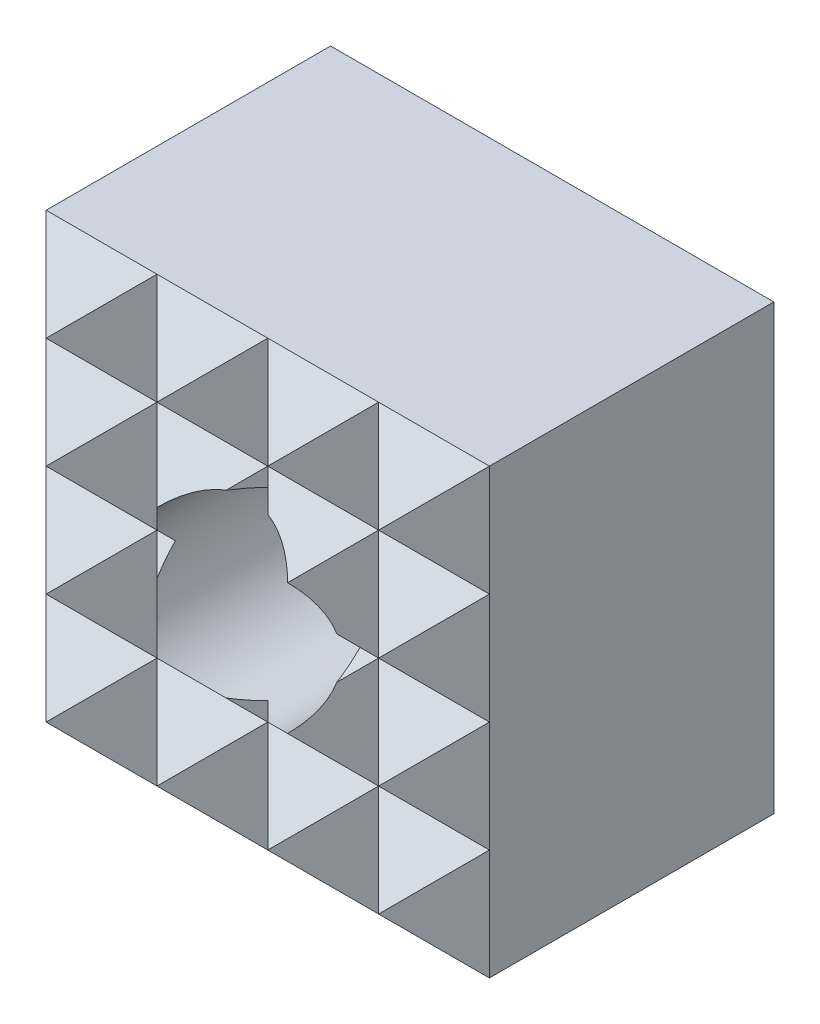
ISO-10303-21;
HEADER;
FILE_DESCRIPTION(('STEP AP214'),'2;1');
FILE_NAME('part.step','',(''),(''),'','','');
FILE_SCHEMA(('AUTOMOTIVE_DESIGN { 1 0 10303 214 1 1 1 1 }'));
ENDSEC;
DATA;
#1=APPLICATION_CONTEXT('core data for automotive mechanical design processes');
#2=APPLICATION_PROTOCOL_DEFINITION('international standard','automotive_design',2000,#1);
#3=PRODUCT_CONTEXT('',#1,'mechanical');
#4=PRODUCT('Part','Part','',(#3));
#5=PRODUCT_RELATED_PRODUCT_CATEGORY('part','',(#4));
#6=PRODUCT_DEFINITION_FORMATION('','',#4);
#7=PRODUCT_DEFINITION_CONTEXT('part definition',#1,'design');
#8=PRODUCT_DEFINITION('design','',#6,#7);
#9=PRODUCT_DEFINITION_SHAPE('','',#8);
#10=(LENGTH_UNIT() NAMED_UNIT(*) SI_UNIT(.MILLI.,.METRE.));
#11=(NAMED_UNIT(*) PLANE_ANGLE_UNIT() SI_UNIT($,.RADIAN.));
#12=(NAMED_UNIT(*) SI_UNIT($,.STERADIAN.) SOLID_ANGLE_UNIT());
#13=UNCERTAINTY_MEASURE_WITH_UNIT(LENGTH_MEASURE(1.E-05),#10,'distance_accuracy_value','');
#14=(GEOMETRIC_REPRESENTATION_CONTEXT(3) GLOBAL_UNCERTAINTY_ASSIGNED_CONTEXT((#13)) GLOBAL_UNIT_ASSIGNED_CONTEXT((#10,
#11,#12)) REPRESENTATION_CONTEXT('',''));
#15=CARTESIAN_POINT('',(0.,0.,0.));
#16=DIRECTION('',(0.,0.,1.));
#17=DIRECTION('',(1.,0.,0.));
#18=AXIS2_PLACEMENT_3D('',#15,#16,#17);
#19=CARTESIAN_POINT('',(-1.49999999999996,-10.,10.));
#20=DIRECTION('',(-0.70710678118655,0.,-0.707106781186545));
#21=DIRECTION('',(-0.707106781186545,0.,0.70710678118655));
#22=AXIS2_PLACEMENT_3D('',#19,#20,#21);
#23=PLANE('',#22);
#24=DIRECTION('',(0.,1.,0.));
#25=VECTOR('',#24,1.);
#26=CARTESIAN_POINT('',(0.,-10.,8.5));
#27=LINE('',#26,#25);
#28=CARTESIAN_POINT('',(0.,2.5,8.5));
#29=VERTEX_POINT('',#28);
#30=CARTESIAN_POINT('',(0.,3.,8.5));
#31=VERTEX_POINT('',#30);
#32=EDGE_CURVE('E512',#29,#31,#27,.T.);
#33=ORIENTED_EDGE('',*,*,#32,.T.);
#34=DIRECTION('',(-0.577350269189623,-0.577350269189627,0.577350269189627));
#35=VECTOR('',#34,1.);
#36=CARTESIAN_POINT('',(-5.33333333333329,-2.33333333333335,13.8333333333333));
#37=LINE('',#36,#35);
#38=CARTESIAN_POINT('',(-0.564585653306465,2.43541434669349,9.0645856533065));
#39=VERTEX_POINT('',#38);
#40=EDGE_CURVE('E496',#31,#39,#37,.T.);
#41=ORIENTED_EDGE('',*,*,#40,.T.);
#42=CARTESIAN_POINT('',(0.,0.,8.5));
#43=DIRECTION('',(-0.70710678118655,0.,-0.707106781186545));
#44=DIRECTION('',(-0.707106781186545,0.,0.70710678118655));
#45=AXIS2_PLACEMENT_3D('',#42,#43,#44);
#46=ELLIPSE('',#45,3.53553390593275,2.5);
#47=EDGE_CURVE('E300',#39,#29,#46,.T.);
#48=ORIENTED_EDGE('',*,*,#47,.T.);
#49=EDGE_LOOP('',(#33,#41,#48));
#50=FACE_BOUND('',#49,.T.);
#51=ADVANCED_FACE('F15',(#50),#23,.F.);
#52=CARTESIAN_POINT('',(0.,-10.,8.5));
#53=DIRECTION('',(0.707106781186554,0.,-0.707106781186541));
#54=DIRECTION('',(-0.707106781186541,0.,-0.707106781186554));
#55=AXIS2_PLACEMENT_3D('',#52,#53,#54);
#56=PLANE('',#55);
#57=CARTESIAN_POINT('',(0.,-3.,8.5));
#58=VERTEX_POINT('',#57);
#59=CARTESIAN_POINT('',(0.,-2.5,8.5));
#60=VERTEX_POINT('',#59);
#61=EDGE_CURVE('E514',#58,#60,#27,.T.);
#62=ORIENTED_EDGE('',*,*,#61,.F.);
#63=DIRECTION('',(0.577350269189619,0.577350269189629,0.57735026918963));
#64=VECTOR('',#63,1.);
#65=CARTESIAN_POINT('',(-2.33333333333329,-5.33333333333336,6.16666666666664));
#66=LINE('',#65,#64);
#67=CARTESIAN_POINT('',(0.564585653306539,-2.43541434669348,9.06458565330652));
#68=VERTEX_POINT('',#67);
#69=EDGE_CURVE('E447',#58,#68,#66,.T.);
#70=ORIENTED_EDGE('',*,*,#69,.T.);
#71=CARTESIAN_POINT('',(0.,0.,8.5));
#72=DIRECTION('',(0.707106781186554,0.,-0.707106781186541));
#73=DIRECTION('',(0.707106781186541,0.,0.707106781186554));
#74=AXIS2_PLACEMENT_3D('',#71,#72,#73);
#75=ELLIPSE('',#74,3.53553390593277,2.5);
#76=EDGE_CURVE('E296',#68,#60,#75,.T.);
#77=ORIENTED_EDGE('',*,*,#76,.T.);
#78=EDGE_LOOP('',(#62,#70,#77));
#79=FACE_BOUND('',#78,.T.);
#80=ADVANCED_FACE('F584',(#79),#56,.F.);
#81=CARTESIAN_POINT('',(-3.,-10.,8.5));
#82=DIRECTION('',(0.707106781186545,0.,-0.70710678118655));
#83=DIRECTION('',(-0.70710678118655,0.,-0.707106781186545));
#84=AXIS2_PLACEMENT_3D('',#81,#82,#83);
#85=PLANE('',#84);
#86=DIRECTION('',(0.,1.,0.));
#87=VECTOR('',#86,1.);
#88=CARTESIAN_POINT('',(-3.,-10.,8.5));
#89=LINE('',#88,#87);
#90=CARTESIAN_POINT('',(-2.99999999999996,0.,8.5));
#91=VERTEX_POINT('',#90);
#92=CARTESIAN_POINT('',(-2.99999999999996,3.,8.5));
#93=VERTEX_POINT('',#92);
#94=EDGE_CURVE('E1309',#91,#93,#89,.T.);
#95=ORIENTED_EDGE('',*,*,#94,.F.);
#96=DIRECTION('',(0.577350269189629,0.577350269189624,0.577350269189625));
#97=VECTOR('',#96,1.);
#98=CARTESIAN_POINT('',(-6.33333333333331,-3.33333333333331,5.16666666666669));
#99=LINE('',#98,#97);
#100=CARTESIAN_POINT('',(-2.43541434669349,0.564585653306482,9.06458565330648));
#101=VERTEX_POINT('',#100);
#102=EDGE_CURVE('E478',#91,#101,#99,.T.);
#103=ORIENTED_EDGE('',*,*,#102,.T.);
#104=CARTESIAN_POINT('',(0.,0.,11.5));
#105=DIRECTION('',(0.707106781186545,0.,-0.70710678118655));
#106=DIRECTION('',(0.70710678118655,0.,0.707106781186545));
#107=AXIS2_PLACEMENT_3D('',#104,#105,#106);
#108=ELLIPSE('',#107,3.53553390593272,2.5);
#109=CARTESIAN_POINT('',(-1.76776695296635,1.76776695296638,9.73223304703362));
#110=VERTEX_POINT('',#109);
#111=EDGE_CURVE('E301',#101,#110,#108,.T.);
#112=ORIENTED_EDGE('',*,*,#111,.T.);
#113=DIRECTION('',(-0.577350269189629,0.577350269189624,-0.577350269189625));
#114=VECTOR('',#113,1.);
#115=CARTESIAN_POINT('',(1.33333333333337,-1.33333333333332,12.8333333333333));
#116=LINE('',#115,#114);
#117=EDGE_CURVE('E249',#110,#93,#116,.T.);
#118=ORIENTED_EDGE('',*,*,#117,.T.);
#119=EDGE_LOOP('',(#95,#103,#112,#118));
#120=FACE_BOUND('',#119,.T.);
#121=ADVANCED_FACE('F632',(#120),#85,.F.);
#122=CARTESIAN_POINT('',(-1.76776695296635,-1.76776695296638,9.73223304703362));
#123=VERTEX_POINT('',#122);
#124=CARTESIAN_POINT('',(-2.43541434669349,-0.564585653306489,9.06458565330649));
#125=VERTEX_POINT('',#124);
#126=EDGE_CURVE('E304',#123,#125,#108,.T.);
#127=ORIENTED_EDGE('',*,*,#126,.T.);
#128=DIRECTION('',(-0.577350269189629,0.577350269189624,-0.577350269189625));
#129=VECTOR('',#128,1.);
#130=CARTESIAN_POINT('',(0.333333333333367,-3.33333333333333,11.8333333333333));
#131=LINE('',#130,#129);
#132=EDGE_CURVE('E462',#125,#91,#131,.T.);
#133=ORIENTED_EDGE('',*,*,#132,.T.);
#134=CARTESIAN_POINT('',(-3.,-3.,8.5));
#135=VERTEX_POINT('',#134);
#136=EDGE_CURVE('E272',#135,#91,#89,.T.);
#137=ORIENTED_EDGE('',*,*,#136,.F.);
#138=DIRECTION('',(0.577350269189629,0.577350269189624,0.577350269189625));
#139=VECTOR('',#138,1.);
#140=CARTESIAN_POINT('',(-5.33333333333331,-5.33333333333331,6.16666666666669));
#141=LINE('',#140,#139);
#142=EDGE_CURVE('E438',#135,#123,#141,.T.);
#143=ORIENTED_EDGE('',*,*,#142,.T.);
#144=EDGE_LOOP('',(#127,#133,#137,#143));
#145=FACE_BOUND('',#144,.T.);
#146=ADVANCED_FACE('F637',(#145),#85,.F.);
#147=CARTESIAN_POINT('',(-0.564585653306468,-2.43541434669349,9.0645856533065));
#148=VERTEX_POINT('',#147);
#149=EDGE_CURVE('E297',#60,#148,#46,.T.);
#150=ORIENTED_EDGE('',*,*,#149,.T.);
#151=DIRECTION('',(0.577350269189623,-0.577350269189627,-0.577350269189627));
#152=VECTOR('',#151,1.);
#153=CARTESIAN_POINT('',(1.33333333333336,-4.33333333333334,7.16666666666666));
#154=LINE('',#153,#152);
#155=EDGE_CURVE('E443',#148,#58,#154,.T.);
#156=ORIENTED_EDGE('',*,*,#155,.T.);
#157=ORIENTED_EDGE('',*,*,#61,.T.);
#158=EDGE_LOOP('',(#150,#156,#157));
#159=FACE_BOUND('',#158,.T.);
#160=ADVANCED_FACE('F587',(#159),#23,.F.);
#161=CARTESIAN_POINT('',(0.564585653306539,2.43541434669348,9.06458565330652));
#162=VERTEX_POINT('',#161);
#163=EDGE_CURVE('E293',#29,#162,#75,.T.);
#164=ORIENTED_EDGE('',*,*,#163,.T.);
#165=DIRECTION('',(-0.577350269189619,0.577350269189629,-0.577350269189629));
#166=VECTOR('',#165,1.);
#167=CARTESIAN_POINT('',(4.33333333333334,-1.33333333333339,12.8333333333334));
#168=LINE('',#167,#166);
#169=EDGE_CURVE('E500',#162,#31,#168,.T.);
#170=ORIENTED_EDGE('',*,*,#169,.T.);
#171=ORIENTED_EDGE('',*,*,#32,.F.);
#172=EDGE_LOOP('',(#164,#170,#171));
#173=FACE_BOUND('',#172,.T.);
#174=ADVANCED_FACE('F633',(#173),#56,.F.);
#175=CARTESIAN_POINT('',(1.5,-10.,10.));
#176=DIRECTION('',(-0.707106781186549,0.,-0.707106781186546));
#177=DIRECTION('',(-0.707106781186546,0.,0.707106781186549));
#178=AXIS2_PLACEMENT_3D('',#175,#176,#177);
#179=PLANE('',#178);
#180=CARTESIAN_POINT('',(0.,0.,11.5));
#181=DIRECTION('',(-0.707106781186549,0.,-0.707106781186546));
#182=DIRECTION('',(-0.707106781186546,0.,0.707106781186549));
#183=AXIS2_PLACEMENT_3D('',#180,#181,#182);
#184=ELLIPSE('',#183,3.53553390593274,2.5);
#185=CARTESIAN_POINT('',(1.76776695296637,1.76776695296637,9.73223304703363));
#186=VERTEX_POINT('',#185);
#187=CARTESIAN_POINT('',(2.43541434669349,0.56458565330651,9.06458565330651));
#188=VERTEX_POINT('',#187);
#189=EDGE_CURVE('E292',#186,#188,#184,.T.);
#190=ORIENTED_EDGE('',*,*,#189,.T.);
#191=DIRECTION('',(0.577350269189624,-0.577350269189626,-0.577350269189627));
#192=VECTOR('',#191,1.);
#193=CARTESIAN_POINT('',(5.33333333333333,-2.33333333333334,6.16666666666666));
#194=LINE('',#193,#192);
#195=CARTESIAN_POINT('',(2.99999999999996,0.,8.5));
#196=VERTEX_POINT('',#195);
#197=EDGE_CURVE('E489',#188,#196,#194,.T.);
#198=ORIENTED_EDGE('',*,*,#197,.T.);
#199=DIRECTION('',(0.,1.,0.));
#200=VECTOR('',#199,1.);
#201=CARTESIAN_POINT('',(3.,-10.,8.5));
#202=LINE('',#201,#200);
#203=CARTESIAN_POINT('',(2.99999999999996,3.,8.5));
#204=VERTEX_POINT('',#203);
#205=EDGE_CURVE('E524',#196,#204,#202,.T.);
#206=ORIENTED_EDGE('',*,*,#205,.T.);
#207=DIRECTION('',(-0.577350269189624,-0.577350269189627,0.577350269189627));
#208=VECTOR('',#207,1.);
#209=CARTESIAN_POINT('',(-2.33333333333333,-2.33333333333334,13.8333333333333));
#210=LINE('',#209,#208);
#211=EDGE_CURVE('E503',#204,#186,#210,.T.);
#212=ORIENTED_EDGE('',*,*,#211,.T.);
#213=EDGE_LOOP('',(#190,#198,#206,#212));
#214=FACE_BOUND('',#213,.T.);
#215=ADVANCED_FACE('F624',(#214),#179,.F.);
#216=CARTESIAN_POINT('',(2.99999999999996,-3.,8.5));
#217=VERTEX_POINT('',#216);
#218=EDGE_CURVE('E518',#217,#196,#202,.T.);
#219=ORIENTED_EDGE('',*,*,#218,.T.);
#220=DIRECTION('',(-0.577350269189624,-0.577350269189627,0.577350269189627));
#221=VECTOR('',#220,1.);
#222=CARTESIAN_POINT('',(-1.33333333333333,-4.33333333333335,12.8333333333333));
#223=LINE('',#222,#221);
#224=CARTESIAN_POINT('',(2.43541434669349,-0.564585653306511,9.06458565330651));
#225=VERTEX_POINT('',#224);
#226=EDGE_CURVE('E474',#196,#225,#223,.T.);
#227=ORIENTED_EDGE('',*,*,#226,.T.);
#228=CARTESIAN_POINT('',(1.76776695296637,-1.76776695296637,9.73223304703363));
#229=VERTEX_POINT('',#228);
#230=EDGE_CURVE('E289',#225,#229,#184,.T.);
#231=ORIENTED_EDGE('',*,*,#230,.T.);
#232=DIRECTION('',(0.577350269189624,-0.577350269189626,-0.577350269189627));
#233=VECTOR('',#232,1.);
#234=CARTESIAN_POINT('',(4.33333333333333,-4.33333333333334,7.16666666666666));
#235=LINE('',#234,#233);
#236=EDGE_CURVE('E450',#229,#217,#235,.T.);
#237=ORIENTED_EDGE('',*,*,#236,.T.);
#238=EDGE_LOOP('',(#219,#227,#231,#237));
#239=FACE_BOUND('',#238,.T.);
#240=ADVANCED_FACE('F563',(#239),#179,.F.);
#241=CARTESIAN_POINT('',(3.,-10.,8.5));
#242=DIRECTION('',(0.707106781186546,0.,-0.707106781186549));
#243=DIRECTION('',(-0.707106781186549,0.,-0.707106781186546));
#244=AXIS2_PLACEMENT_3D('',#241,#242,#243);
#245=PLANE('',#244);
#246=ORIENTED_EDGE('',*,*,#218,.F.);
#247=DIRECTION('',(0.577350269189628,0.577350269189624,0.577350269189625));
#248=VECTOR('',#247,1.);
#249=CARTESIAN_POINT('',(0.666666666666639,-5.33333333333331,6.16666666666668));
#250=LINE('',#249,#248);
#251=CARTESIAN_POINT('',(4.49999999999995,-1.5,10.));
#252=VERTEX_POINT('',#251);
#253=EDGE_CURVE('E453',#217,#252,#250,.T.);
#254=ORIENTED_EDGE('',*,*,#253,.T.);
#255=DIRECTION('',(-0.577350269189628,0.577350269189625,-0.577350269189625));
#256=VECTOR('',#255,1.);
#257=CARTESIAN_POINT('',(6.33333333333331,-3.33333333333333,11.8333333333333));
#258=LINE('',#257,#256);
#259=EDGE_CURVE('E471',#252,#196,#258,.T.);
#260=ORIENTED_EDGE('',*,*,#259,.T.);
#261=EDGE_LOOP('',(#246,#254,#260));
#262=FACE_BOUND('',#261,.T.);
#263=ADVANCED_FACE('F561',(#262),#245,.F.);
#264=ORIENTED_EDGE('',*,*,#205,.F.);
#265=DIRECTION('',(0.577350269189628,0.577350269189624,0.577350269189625));
#266=VECTOR('',#265,1.);
#267=CARTESIAN_POINT('',(-0.333333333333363,-3.33333333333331,5.16666666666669));
#268=LINE('',#267,#266);
#269=CARTESIAN_POINT('',(4.49999999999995,1.5,10.));
#270=VERTEX_POINT('',#269);
#271=EDGE_CURVE('E486',#196,#270,#268,.T.);
#272=ORIENTED_EDGE('',*,*,#271,.T.);
#273=DIRECTION('',(-0.577350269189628,0.577350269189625,-0.577350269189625));
#274=VECTOR('',#273,1.);
#275=CARTESIAN_POINT('',(7.33333333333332,-1.33333333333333,12.8333333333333));
#276=LINE('',#275,#274);
#277=EDGE_CURVE('E506',#270,#204,#276,.T.);
#278=ORIENTED_EDGE('',*,*,#277,.T.);
#279=EDGE_LOOP('',(#264,#272,#278));
#280=FACE_BOUND('',#279,.T.);
#281=ADVANCED_FACE('F687',(#280),#245,.F.);
#282=CARTESIAN_POINT('',(4.5,-10.,10.));
#283=DIRECTION('',(-0.70710678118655,0.,-0.707106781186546));
#284=DIRECTION('',(-0.707106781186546,0.,0.70710678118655));
#285=AXIS2_PLACEMENT_3D('',#282,#283,#284);
#286=PLANE('',#285);
#287=DIRECTION('',(-0.577350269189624,-0.577350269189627,0.577350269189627));
#288=VECTOR('',#287,1.);
#289=CARTESIAN_POINT('',(2.66666666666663,-6.33333333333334,11.8333333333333));
#290=LINE('',#289,#288);
#291=CARTESIAN_POINT('',(6.,-3.,8.5));
#292=VERTEX_POINT('',#291);
#293=CARTESIAN_POINT('',(4.5,-4.5,10.));
#294=VERTEX_POINT('',#293);
#295=EDGE_CURVE('E433',#292,#294,#290,.T.);
#296=ORIENTED_EDGE('',*,*,#295,.T.);
#297=DIRECTION('',(0.577350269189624,-0.577350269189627,-0.577350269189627));
#298=VECTOR('',#297,1.);
#299=CARTESIAN_POINT('',(6.33333333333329,-6.33333333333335,8.16666666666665));
#300=LINE('',#299,#298);
#301=CARTESIAN_POINT('',(6.,-6.,8.5));
#302=VERTEX_POINT('',#301);
#303=EDGE_CURVE('E412',#294,#302,#300,.T.);
#304=ORIENTED_EDGE('',*,*,#303,.T.);
#305=DIRECTION('',(0.,1.,0.));
#306=VECTOR('',#305,1.);
#307=CARTESIAN_POINT('',(6.,-10.,8.5));
#308=LINE('',#307,#306);
#309=EDGE_CURVE('E269',#302,#292,#308,.T.);
#310=ORIENTED_EDGE('',*,*,#309,.T.);
#311=EDGE_LOOP('',(#296,#304,#310));
#312=FACE_BOUND('',#311,.T.);
#313=ADVANCED_FACE('F700',(#312),#286,.F.);
#314=DIRECTION('',(-0.577350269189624,-0.577350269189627,0.577350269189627));
#315=VECTOR('',#314,1.);
#316=CARTESIAN_POINT('',(1.66666666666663,-4.33333333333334,12.8333333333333));
#317=LINE('',#316,#315);
#318=CARTESIAN_POINT('',(6.,0.,8.5));
#319=VERTEX_POINT('',#318);
#320=EDGE_CURVE('E467',#319,#252,#317,.T.);
#321=ORIENTED_EDGE('',*,*,#320,.T.);
#322=DIRECTION('',(0.577350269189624,-0.577350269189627,-0.577350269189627));
#323=VECTOR('',#322,1.);
#324=CARTESIAN_POINT('',(7.33333333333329,-4.33333333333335,7.16666666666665));
#325=LINE('',#324,#323);
#326=EDGE_CURVE('E456',#252,#292,#325,.T.);
#327=ORIENTED_EDGE('',*,*,#326,.T.);
#328=EDGE_CURVE('E530',#292,#319,#308,.T.);
#329=ORIENTED_EDGE('',*,*,#328,.T.);
#330=EDGE_LOOP('',(#321,#327,#329));
#331=FACE_BOUND('',#330,.T.);
#332=ADVANCED_FACE('F545',(#331),#286,.F.);
#333=DIRECTION('',(-0.577350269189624,-0.577350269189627,0.577350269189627));
#334=VECTOR('',#333,1.);
#335=CARTESIAN_POINT('',(0.666666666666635,-2.33333333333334,13.8333333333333));
#336=LINE('',#335,#334);
#337=CARTESIAN_POINT('',(6.,3.,8.5));
#338=VERTEX_POINT('',#337);
#339=EDGE_CURVE('E509',#338,#270,#336,.T.);
#340=ORIENTED_EDGE('',*,*,#339,.T.);
#341=DIRECTION('',(0.577350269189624,-0.577350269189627,-0.577350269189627));
#342=VECTOR('',#341,1.);
#343=CARTESIAN_POINT('',(8.33333333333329,-2.33333333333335,6.16666666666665));
#344=LINE('',#343,#342);
#345=EDGE_CURVE('E483',#270,#319,#344,.T.);
#346=ORIENTED_EDGE('',*,*,#345,.T.);
#347=EDGE_CURVE('E534',#319,#338,#308,.T.);
#348=ORIENTED_EDGE('',*,*,#347,.T.);
#349=EDGE_LOOP('',(#340,#346,#348));
#350=FACE_BOUND('',#349,.T.);
#351=ADVANCED_FACE('F541',(#350),#286,.F.);
#352=CARTESIAN_POINT('',(-6.,-10.,8.5));
#353=DIRECTION('',(0.707106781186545,0.,-0.70710678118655));
#354=DIRECTION('',(-0.70710678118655,0.,-0.707106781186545));
#355=AXIS2_PLACEMENT_3D('',#352,#353,#354);
#356=PLANE('',#355);
#357=DIRECTION('',(0.,1.,0.));
#358=VECTOR('',#357,1.);
#359=CARTESIAN_POINT('',(-6.,-10.,8.5));
#360=LINE('',#359,#358);
#361=CARTESIAN_POINT('',(-6.,-6.,8.5));
#362=VERTEX_POINT('',#361);
#363=CARTESIAN_POINT('',(-6.,-3.,8.5));
#364=VERTEX_POINT('',#363);
#365=EDGE_CURVE('E261',#362,#364,#360,.T.);
#366=ORIENTED_EDGE('',*,*,#365,.F.);
#367=DIRECTION('',(0.577350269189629,0.577350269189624,0.577350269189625));
#368=VECTOR('',#367,1.);
#369=CARTESIAN_POINT('',(-7.33333333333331,-7.33333333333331,7.16666666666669));
#370=LINE('',#369,#368);
#371=CARTESIAN_POINT('',(-4.49999999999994,-4.5,10.));
#372=VERTEX_POINT('',#371);
#373=EDGE_CURVE('E394',#362,#372,#370,.T.);
#374=ORIENTED_EDGE('',*,*,#373,.T.);
#375=DIRECTION('',(-0.577350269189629,0.577350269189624,-0.577350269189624));
#376=VECTOR('',#375,1.);
#377=CARTESIAN_POINT('',(-3.66666666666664,-5.33333333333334,10.8333333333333));
#378=LINE('',#377,#376);
#379=EDGE_CURVE('E415',#372,#364,#378,.T.);
#380=ORIENTED_EDGE('',*,*,#379,.T.);
#381=EDGE_LOOP('',(#366,#374,#380));
#382=FACE_BOUND('',#381,.T.);
#383=ADVANCED_FACE('F1054',(#382),#356,.F.);
#384=CARTESIAN_POINT('',(-6.,0.,8.5));
#385=VERTEX_POINT('',#384);
#386=EDGE_CURVE('E265',#364,#385,#360,.T.);
#387=ORIENTED_EDGE('',*,*,#386,.F.);
#388=DIRECTION('',(0.577350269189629,0.577350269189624,0.577350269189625));
#389=VECTOR('',#388,1.);
#390=CARTESIAN_POINT('',(-8.33333333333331,-5.3333333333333,6.16666666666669));
#391=LINE('',#390,#389);
#392=CARTESIAN_POINT('',(-4.49999999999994,-1.5,10.));
#393=VERTEX_POINT('',#392);
#394=EDGE_CURVE('E435',#364,#393,#391,.T.);
#395=ORIENTED_EDGE('',*,*,#394,.T.);
#396=DIRECTION('',(-0.577350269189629,0.577350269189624,-0.577350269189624));
#397=VECTOR('',#396,1.);
#398=CARTESIAN_POINT('',(-2.66666666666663,-3.33333333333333,11.8333333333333));
#399=LINE('',#398,#397);
#400=EDGE_CURVE('E459',#393,#385,#399,.T.);
#401=ORIENTED_EDGE('',*,*,#400,.T.);
#402=EDGE_LOOP('',(#387,#395,#401));
#403=FACE_BOUND('',#402,.T.);
#404=ADVANCED_FACE('F1046',(#403),#356,.F.);
#405=CARTESIAN_POINT('',(-6.,3.,8.5));
#406=VERTEX_POINT('',#405);
#407=EDGE_CURVE('E246',#385,#406,#360,.T.);
#408=ORIENTED_EDGE('',*,*,#407,.F.);
#409=DIRECTION('',(0.577350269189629,0.577350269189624,0.577350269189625));
#410=VECTOR('',#409,1.);
#411=CARTESIAN_POINT('',(-9.33333333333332,-3.33333333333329,5.1666666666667));
#412=LINE('',#411,#410);
#413=CARTESIAN_POINT('',(-4.49999999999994,1.5,10.));
#414=VERTEX_POINT('',#413);
#415=EDGE_CURVE('E248',#385,#414,#412,.T.);
#416=ORIENTED_EDGE('',*,*,#415,.T.);
#417=DIRECTION('',(-0.577350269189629,0.577350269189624,-0.577350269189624));
#418=VECTOR('',#417,1.);
#419=CARTESIAN_POINT('',(-1.66666666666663,-1.33333333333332,12.8333333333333));
#420=LINE('',#419,#418);
#421=EDGE_CURVE('E233',#414,#406,#420,.T.);
#422=ORIENTED_EDGE('',*,*,#421,.T.);
#423=EDGE_LOOP('',(#408,#416,#422));
#424=FACE_BOUND('',#423,.T.);
#425=ADVANCED_FACE('F244',(#424),#356,.F.);
#426=CARTESIAN_POINT('',(-4.5,-10.,10.));
#427=DIRECTION('',(-0.70710678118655,0.,-0.707106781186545));
#428=DIRECTION('',(-0.707106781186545,0.,0.70710678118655));
#429=AXIS2_PLACEMENT_3D('',#426,#427,#428);
#430=PLANE('',#429);
#431=DIRECTION('',(-0.577350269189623,-0.577350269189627,0.577350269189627));
#432=VECTOR('',#431,1.);
#433=CARTESIAN_POINT('',(-7.33333333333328,-4.33333333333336,12.8333333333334));
#434=LINE('',#433,#432);
#435=EDGE_CURVE('E312',#91,#393,#434,.T.);
#436=ORIENTED_EDGE('',*,*,#435,.T.);
#437=DIRECTION('',(0.577350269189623,-0.577350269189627,-0.577350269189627));
#438=VECTOR('',#437,1.);
#439=CARTESIAN_POINT('',(-1.66666666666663,-4.33333333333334,7.16666666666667));
#440=LINE('',#439,#438);
#441=EDGE_CURVE('E315',#393,#135,#440,.T.);
#442=ORIENTED_EDGE('',*,*,#441,.T.);
#443=ORIENTED_EDGE('',*,*,#136,.T.);
#444=EDGE_LOOP('',(#436,#442,#443));
#445=FACE_BOUND('',#444,.T.);
#446=ADVANCED_FACE('F970',(#445),#430,.F.);
#447=DIRECTION('',(-0.577350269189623,-0.577350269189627,0.577350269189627));
#448=VECTOR('',#447,1.);
#449=CARTESIAN_POINT('',(-8.33333333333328,-2.33333333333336,13.8333333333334));
#450=LINE('',#449,#448);
#451=EDGE_CURVE('E236',#93,#414,#450,.T.);
#452=ORIENTED_EDGE('',*,*,#451,.T.);
#453=DIRECTION('',(0.577350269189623,-0.577350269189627,-0.577350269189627));
#454=VECTOR('',#453,1.);
#455=CARTESIAN_POINT('',(-0.666666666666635,-2.33333333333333,6.16666666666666));
#456=LINE('',#455,#454);
#457=EDGE_CURVE('E309',#414,#91,#456,.T.);
#458=ORIENTED_EDGE('',*,*,#457,.T.);
#459=ORIENTED_EDGE('',*,*,#94,.T.);
#460=EDGE_LOOP('',(#452,#458,#459));
#461=FACE_BOUND('',#460,.T.);
#462=ADVANCED_FACE('F953',(#461),#430,.F.);
#463=CARTESIAN_POINT('',(-6.,-6.,0.));
#464=DIRECTION('',(0.,0.,-1.));
#465=DIRECTION('',(-1.,0.,0.));
#466=AXIS2_PLACEMENT_3D('',#463,#464,#465);
#467=PLANE('',#466);
#468=DIRECTION('',(-1.,0.,0.));
#469=VECTOR('',#468,1.);
#470=CARTESIAN_POINT('',(-6.,-5.2,0.));
#471=LINE('',#470,#469);
#472=CARTESIAN_POINT('',(5.2,-5.2,0.));
#473=VERTEX_POINT('',#472);
#474=CARTESIAN_POINT('',(-5.2,-5.2,0.));
#475=VERTEX_POINT('',#474);
#476=EDGE_CURVE('E331',#473,#475,#471,.T.);
#477=ORIENTED_EDGE('',*,*,#476,.T.);
#478=DIRECTION('',(0.,1.,0.));
#479=VECTOR('',#478,1.);
#480=CARTESIAN_POINT('',(-5.2,6.,0.));
#481=LINE('',#480,#479);
#482=CARTESIAN_POINT('',(-5.2,5.2,0.));
#483=VERTEX_POINT('',#482);
#484=EDGE_CURVE('E333',#475,#483,#481,.T.);
#485=ORIENTED_EDGE('',*,*,#484,.T.);
#486=DIRECTION('',(1.,0.,0.));
#487=VECTOR('',#486,1.);
#488=CARTESIAN_POINT('',(-6.,5.2,0.));
#489=LINE('',#488,#487);
#490=CARTESIAN_POINT('',(5.2,5.2,0.));
#491=VERTEX_POINT('',#490);
#492=EDGE_CURVE('E327',#483,#491,#489,.T.);
#493=ORIENTED_EDGE('',*,*,#492,.T.);
#494=DIRECTION('',(0.,-1.,0.));
#495=VECTOR('',#494,1.);
#496=CARTESIAN_POINT('',(5.2,-6.,0.));
#497=LINE('',#496,#495);
#498=EDGE_CURVE('E329',#491,#473,#497,.T.);
#499=ORIENTED_EDGE('',*,*,#498,.T.);
#500=EDGE_LOOP('',(#477,#485,#493,#499));
#501=FACE_BOUND('',#500,.T.);
#502=CARTESIAN_POINT('',(0.,0.,0.));
#503=DIRECTION('',(0.,0.,-1.));
#504=DIRECTION('',(-1.,0.,0.));
#505=AXIS2_PLACEMENT_3D('',#502,#503,#504);
#506=CIRCLE('',#505,2.95);
#507=CARTESIAN_POINT('',(-2.95,0.,0.));
#508=VERTEX_POINT('',#507);
#509=EDGE_CURVE('E283',#508,#508,#506,.F.);
#510=ORIENTED_EDGE('',*,*,#509,.T.);
#511=EDGE_LOOP('',(#510));
#512=FACE_BOUND('',#511,.T.);
#513=ADVANCED_FACE('F1030',(#501,#512),#467,.T.);
#514=CARTESIAN_POINT('',(-6.,6.,10.));
#515=DIRECTION('',(1.,0.,0.));
#516=DIRECTION('',(0.,1.,0.));
#517=AXIS2_PLACEMENT_3D('',#514,#515,#516);
#518=PLANE('',#517);
#519=DIRECTION('',(0.,0.,-1.));
#520=VECTOR('',#519,1.);
#521=CARTESIAN_POINT('',(-6.,6.,10.));
#522=LINE('',#521,#520);
#523=CARTESIAN_POINT('',(-6.,6.,8.5));
#524=VERTEX_POINT('',#523);
#525=CARTESIAN_POINT('',(-6.,6.,0.8));
#526=VERTEX_POINT('',#525);
#527=EDGE_CURVE('E274',#524,#526,#522,.T.);
#528=ORIENTED_EDGE('',*,*,#527,.T.);
#529=DIRECTION('',(0.,-1.,0.));
#530=VECTOR('',#529,1.);
#531=CARTESIAN_POINT('',(-6.,-6.,0.8));
#532=LINE('',#531,#530);
#533=CARTESIAN_POINT('',(-6.,-6.,0.8));
#534=VERTEX_POINT('',#533);
#535=EDGE_CURVE('E324',#526,#534,#532,.T.);
#536=ORIENTED_EDGE('',*,*,#535,.T.);
#537=DIRECTION('',(0.,0.,-1.));
#538=VECTOR('',#537,1.);
#539=CARTESIAN_POINT('',(-6.,-6.,10.));
#540=LINE('',#539,#538);
#541=EDGE_CURVE('E281',#362,#534,#540,.T.);
#542=ORIENTED_EDGE('',*,*,#541,.F.);
#543=ORIENTED_EDGE('',*,*,#365,.T.);
#544=ORIENTED_EDGE('',*,*,#386,.T.);
#545=ORIENTED_EDGE('',*,*,#407,.T.);
#546=EDGE_CURVE('E253',#406,#524,#360,.T.);
#547=ORIENTED_EDGE('',*,*,#546,.T.);
#548=EDGE_LOOP('',(#528,#536,#542,#543,#544,#545,#547));
#549=FACE_BOUND('',#548,.T.);
#550=ADVANCED_FACE('F262',(#549),#518,.F.);
#551=CARTESIAN_POINT('',(6.,-6.,10.));
#552=DIRECTION('',(0.,-1.,0.));
#553=DIRECTION('',(1.,0.,0.));
#554=AXIS2_PLACEMENT_3D('',#551,#552,#553);
#555=PLANE('',#554);
#556=ORIENTED_EDGE('',*,*,#541,.T.);
#557=DIRECTION('',(1.,0.,0.));
#558=VECTOR('',#557,1.);
#559=CARTESIAN_POINT('',(6.,-6.,0.8));
#560=LINE('',#559,#558);
#561=CARTESIAN_POINT('',(6.,-6.,0.8));
#562=VERTEX_POINT('',#561);
#563=EDGE_CURVE('E39',#534,#562,#560,.T.);
#564=ORIENTED_EDGE('',*,*,#563,.T.);
#565=DIRECTION('',(0.,0.,-1.));
#566=VECTOR('',#565,1.);
#567=CARTESIAN_POINT('',(6.,-6.,10.));
#568=LINE('',#567,#566);
#569=EDGE_CURVE('E279',#302,#562,#568,.T.);
#570=ORIENTED_EDGE('',*,*,#569,.F.);
#571=DIRECTION('',(1.,0.,0.));
#572=VECTOR('',#571,1.);
#573=CARTESIAN_POINT('',(-10.,-6.,8.5));
#574=LINE('',#573,#572);
#575=CARTESIAN_POINT('',(2.99999999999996,-6.,8.5));
#576=VERTEX_POINT('',#575);
#577=EDGE_CURVE('E670',#576,#302,#574,.T.);
#578=ORIENTED_EDGE('',*,*,#577,.F.);
#579=CARTESIAN_POINT('',(0.,-6.,8.5));
#580=VERTEX_POINT('',#579);
#581=EDGE_CURVE('E601',#580,#576,#574,.T.);
#582=ORIENTED_EDGE('',*,*,#581,.F.);
#583=CARTESIAN_POINT('',(-2.99999999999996,-6.,8.5));
#584=VERTEX_POINT('',#583);
#585=EDGE_CURVE('E1297',#584,#580,#574,.T.);
#586=ORIENTED_EDGE('',*,*,#585,.F.);
#587=EDGE_CURVE('E671',#362,#584,#574,.T.);
#588=ORIENTED_EDGE('',*,*,#587,.F.);
#589=EDGE_LOOP('',(#556,#564,#570,#578,#582,#586,#588));
#590=FACE_BOUND('',#589,.T.);
#591=ADVANCED_FACE('F1206',(#590),#555,.T.);
#592=CARTESIAN_POINT('',(6.,-6.,10.));
#593=DIRECTION('',(-1.,0.,0.));
#594=DIRECTION('',(0.,0.,1.));
#595=AXIS2_PLACEMENT_3D('',#592,#593,#594);
#596=PLANE('',#595);
#597=ORIENTED_EDGE('',*,*,#569,.T.);
#598=DIRECTION('',(0.,1.,0.));
#599=VECTOR('',#598,1.);
#600=CARTESIAN_POINT('',(6.,6.,0.8));
#601=LINE('',#600,#599);
#602=CARTESIAN_POINT('',(6.,6.,0.8));
#603=VERTEX_POINT('',#602);
#604=EDGE_CURVE('E24',#562,#603,#601,.T.);
#605=ORIENTED_EDGE('',*,*,#604,.T.);
#606=DIRECTION('',(0.,0.,-1.));
#607=VECTOR('',#606,1.);
#608=CARTESIAN_POINT('',(6.,6.,10.));
#609=LINE('',#608,#607);
#610=CARTESIAN_POINT('',(6.,6.,8.5));
#611=VERTEX_POINT('',#610);
#612=EDGE_CURVE('E276',#611,#603,#609,.T.);
#613=ORIENTED_EDGE('',*,*,#612,.F.);
#614=EDGE_CURVE('E268',#338,#611,#308,.T.);
#615=ORIENTED_EDGE('',*,*,#614,.F.);
#616=ORIENTED_EDGE('',*,*,#347,.F.);
#617=ORIENTED_EDGE('',*,*,#328,.F.);
#618=ORIENTED_EDGE('',*,*,#309,.F.);
#619=EDGE_LOOP('',(#597,#605,#613,#615,#616,#617,#618));
#620=FACE_BOUND('',#619,.T.);
#621=ADVANCED_FACE('F543',(#620),#596,.F.);
#622=CARTESIAN_POINT('',(-6.,6.,10.));
#623=DIRECTION('',(0.,1.,0.));
#624=DIRECTION('',(-1.,0.,0.));
#625=AXIS2_PLACEMENT_3D('',#622,#623,#624);
#626=PLANE('',#625);
#627=ORIENTED_EDGE('',*,*,#612,.T.);
#628=DIRECTION('',(-1.,0.,0.));
#629=VECTOR('',#628,1.);
#630=CARTESIAN_POINT('',(-6.,6.,0.8));
#631=LINE('',#630,#629);
#632=EDGE_CURVE('E9',#603,#526,#631,.T.);
#633=ORIENTED_EDGE('',*,*,#632,.T.);
#634=ORIENTED_EDGE('',*,*,#527,.F.);
#635=DIRECTION('',(1.,0.,0.));
#636=VECTOR('',#635,1.);
#637=CARTESIAN_POINT('',(-10.,6.,8.5));
#638=LINE('',#637,#636);
#639=CARTESIAN_POINT('',(-2.99999999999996,6.,8.5));
#640=VERTEX_POINT('',#639);
#641=EDGE_CURVE('E666',#524,#640,#638,.T.);
#642=ORIENTED_EDGE('',*,*,#641,.T.);
#643=CARTESIAN_POINT('',(0.,6.,8.5));
#644=VERTEX_POINT('',#643);
#645=EDGE_CURVE('E663',#640,#644,#638,.T.);
#646=ORIENTED_EDGE('',*,*,#645,.T.);
#647=CARTESIAN_POINT('',(3.,6.,8.5));
#648=VERTEX_POINT('',#647);
#649=EDGE_CURVE('E659',#644,#648,#638,.T.);
#650=ORIENTED_EDGE('',*,*,#649,.T.);
#651=EDGE_CURVE('E237',#648,#611,#638,.T.);
#652=ORIENTED_EDGE('',*,*,#651,.T.);
#653=EDGE_LOOP('',(#627,#633,#634,#642,#646,#650,#652));
#654=FACE_BOUND('',#653,.T.);
#655=ADVANCED_FACE('F665',(#654),#626,.T.);
#656=CARTESIAN_POINT('',(0.,0.,10.));
#657=DIRECTION('',(0.,0.,1.));
#658=DIRECTION('',(1.,0.,0.));
#659=AXIS2_PLACEMENT_3D('',#656,#657,#658);
#660=CYLINDRICAL_SURFACE('',#659,2.5);
#661=CARTESIAN_POINT('',(0.,0.,11.5));
#662=DIRECTION('',(0.,-0.707106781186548,-0.707106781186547));
#663=DIRECTION('',(0.,-0.707106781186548,0.707106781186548));
#664=AXIS2_PLACEMENT_3D('',#661,#662,#663);
#665=ELLIPSE('',#664,3.53553390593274,2.5);
#666=EDGE_CURVE('E494',#110,#39,#665,.T.);
#667=ORIENTED_EDGE('',*,*,#666,.F.);
#668=ORIENTED_EDGE('',*,*,#111,.F.);
#669=CARTESIAN_POINT('',(0.,0.,8.5));
#670=DIRECTION('',(0.,0.707106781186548,-0.707106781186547));
#671=DIRECTION('',(0.,0.707106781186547,0.707106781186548));
#672=AXIS2_PLACEMENT_3D('',#669,#670,#671);
#673=ELLIPSE('',#672,3.53553390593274,2.5);
#674=CARTESIAN_POINT('',(-2.5,0.,8.5));
#675=VERTEX_POINT('',#674);
#676=EDGE_CURVE('E481',#675,#101,#673,.T.);
#677=ORIENTED_EDGE('',*,*,#676,.F.);
#678=CARTESIAN_POINT('',(0.,0.,8.5));
#679=DIRECTION('',(0.,-0.707106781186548,-0.707106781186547));
#680=DIRECTION('',(0.,-0.707106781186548,0.707106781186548));
#681=AXIS2_PLACEMENT_3D('',#678,#679,#680);
#682=ELLIPSE('',#681,3.53553390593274,2.5);
#683=EDGE_CURVE('E465',#125,#675,#682,.T.);
#684=ORIENTED_EDGE('',*,*,#683,.F.);
#685=ORIENTED_EDGE('',*,*,#126,.F.);
#686=CARTESIAN_POINT('',(0.,0.,11.5));
#687=DIRECTION('',(0.,0.707106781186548,-0.707106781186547));
#688=DIRECTION('',(0.,0.707106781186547,0.707106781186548));
#689=AXIS2_PLACEMENT_3D('',#686,#687,#688);
#690=ELLIPSE('',#689,3.53553390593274,2.5);
#691=EDGE_CURVE('E441',#148,#123,#690,.T.);
#692=ORIENTED_EDGE('',*,*,#691,.F.);
#693=ORIENTED_EDGE('',*,*,#149,.F.);
#694=ORIENTED_EDGE('',*,*,#76,.F.);
#695=EDGE_CURVE('E444',#229,#68,#690,.T.);
#696=ORIENTED_EDGE('',*,*,#695,.F.);
#697=ORIENTED_EDGE('',*,*,#230,.F.);
#698=CARTESIAN_POINT('',(2.5,0.,8.5));
#699=VERTEX_POINT('',#698);
#700=EDGE_CURVE('E468',#699,#225,#682,.T.);
#701=ORIENTED_EDGE('',*,*,#700,.F.);
#702=EDGE_CURVE('E250',#188,#699,#673,.T.);
#703=ORIENTED_EDGE('',*,*,#702,.F.);
#704=ORIENTED_EDGE('',*,*,#189,.F.);
#705=EDGE_CURVE('E497',#162,#186,#665,.T.);
#706=ORIENTED_EDGE('',*,*,#705,.F.);
#707=ORIENTED_EDGE('',*,*,#163,.F.);
#708=ORIENTED_EDGE('',*,*,#47,.F.);
#709=EDGE_LOOP('',(#667,#668,#677,#684,#685,#692,#693,#694,#696,#697,#701,#703,#704,#706,#707,#708));
#710=FACE_BOUND('',#709,.T.);
#711=CARTESIAN_POINT('',(0.,0.,0.45));
#712=DIRECTION('',(0.,0.,-1.));
#713=DIRECTION('',(-1.,0.,0.));
#714=AXIS2_PLACEMENT_3D('',#711,#712,#713);
#715=CIRCLE('',#714,2.5);
#716=CARTESIAN_POINT('',(-2.5,0.,0.45));
#717=VERTEX_POINT('',#716);
#718=EDGE_CURVE('E286',#717,#717,#715,.T.);
#719=ORIENTED_EDGE('',*,*,#718,.T.);
#720=EDGE_LOOP('',(#719));
#721=FACE_BOUND('',#720,.T.);
#722=ADVANCED_FACE('F576',(#710,#721),#660,.F.);
#723=CARTESIAN_POINT('',(0.,0.,0.));
#724=DIRECTION('',(0.,0.,-1.));
#725=DIRECTION('',(-1.,0.,0.));
#726=AXIS2_PLACEMENT_3D('',#723,#724,#725);
#727=CONICAL_SURFACE('',#726,2.95,0.785398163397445);
#728=ORIENTED_EDGE('',*,*,#718,.F.);
#729=EDGE_LOOP('',(#728));
#730=FACE_BOUND('',#729,.T.);
#731=ORIENTED_EDGE('',*,*,#509,.F.);
#732=EDGE_LOOP('',(#731));
#733=FACE_BOUND('',#732,.T.);
#734=ADVANCED_FACE('F1020',(#730,#733),#727,.F.);
#735=ORIENTED_EDGE('',*,*,#614,.T.);
#736=DIRECTION('',(-0.577350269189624,-0.577350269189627,0.577350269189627));
#737=VECTOR('',#736,1.);
#738=CARTESIAN_POINT('',(-0.333333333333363,-0.333333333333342,14.8333333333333));
#739=LINE('',#738,#737);
#740=CARTESIAN_POINT('',(4.5,4.5,10.));
#741=VERTEX_POINT('',#740);
#742=EDGE_CURVE('E392',#611,#741,#739,.T.);
#743=ORIENTED_EDGE('',*,*,#742,.T.);
#744=DIRECTION('',(0.577350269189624,-0.577350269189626,-0.577350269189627));
#745=VECTOR('',#744,1.);
#746=CARTESIAN_POINT('',(9.33333333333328,-0.333333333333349,5.16666666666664));
#747=LINE('',#746,#745);
#748=EDGE_CURVE('E375',#741,#338,#747,.T.);
#749=ORIENTED_EDGE('',*,*,#748,.T.);
#750=EDGE_LOOP('',(#735,#743,#749));
#751=FACE_BOUND('',#750,.T.);
#752=ADVANCED_FACE('F675',(#751),#286,.F.);
#753=DIRECTION('',(0.577350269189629,0.577350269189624,0.577350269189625));
#754=VECTOR('',#753,1.);
#755=CARTESIAN_POINT('',(-10.3333333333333,-1.33333333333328,4.16666666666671));
#756=LINE('',#755,#754);
#757=CARTESIAN_POINT('',(-4.5,4.5,10.));
#758=VERTEX_POINT('',#757);
#759=EDGE_CURVE('E216',#406,#758,#756,.T.);
#760=ORIENTED_EDGE('',*,*,#759,.T.);
#761=DIRECTION('',(-0.577350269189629,0.577350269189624,-0.577350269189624));
#762=VECTOR('',#761,1.);
#763=CARTESIAN_POINT('',(-0.666666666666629,0.666666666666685,13.8333333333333));
#764=LINE('',#763,#762);
#765=EDGE_CURVE('E255',#758,#524,#764,.T.);
#766=ORIENTED_EDGE('',*,*,#765,.T.);
#767=ORIENTED_EDGE('',*,*,#546,.F.);
#768=EDGE_LOOP('',(#760,#766,#767));
#769=FACE_BOUND('',#768,.T.);
#770=ADVANCED_FACE('F254',(#769),#356,.F.);
#771=CARTESIAN_POINT('',(-10.,4.5,10.));
#772=DIRECTION('',(0.,0.707106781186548,-0.707106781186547));
#773=DIRECTION('',(0.,0.707106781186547,0.707106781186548));
#774=AXIS2_PLACEMENT_3D('',#771,#772,#773);
#775=PLANE('',#774);
#776=DIRECTION('',(1.,0.,0.));
#777=VECTOR('',#776,1.);
#778=CARTESIAN_POINT('',(-10.,3.,8.5));
#779=LINE('',#778,#777);
#780=EDGE_CURVE('E219',#406,#93,#779,.T.);
#781=ORIENTED_EDGE('',*,*,#780,.T.);
#782=DIRECTION('',(0.577350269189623,-0.577350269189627,-0.577350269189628));
#783=VECTOR('',#782,1.);
#784=CARTESIAN_POINT('',(0.333333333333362,-0.333333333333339,5.16666666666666));
#785=LINE('',#784,#783);
#786=EDGE_CURVE('E222',#758,#93,#785,.T.);
#787=ORIENTED_EDGE('',*,*,#786,.F.);
#788=ORIENTED_EDGE('',*,*,#759,.F.);
#789=EDGE_LOOP('',(#781,#787,#788));
#790=FACE_BOUND('',#789,.T.);
#791=ADVANCED_FACE('F218',(#790),#775,.F.);
#792=CARTESIAN_POINT('',(-10.,3.,8.5));
#793=DIRECTION('',(0.,-0.707106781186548,-0.707106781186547));
#794=DIRECTION('',(0.,0.707106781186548,-0.707106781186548));
#795=AXIS2_PLACEMENT_3D('',#792,#793,#794);
#796=PLANE('',#795);
#797=ORIENTED_EDGE('',*,*,#451,.F.);
#798=ORIENTED_EDGE('',*,*,#780,.F.);
#799=ORIENTED_EDGE('',*,*,#421,.F.);
#800=EDGE_LOOP('',(#797,#798,#799));
#801=FACE_BOUND('',#800,.T.);
#802=ADVANCED_FACE('F232',(#801),#796,.F.);
#803=CARTESIAN_POINT('',(-10.,6.,8.5));
#804=DIRECTION('',(0.,-0.707106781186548,-0.707106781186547));
#805=DIRECTION('',(0.,0.707106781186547,-0.707106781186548));
#806=AXIS2_PLACEMENT_3D('',#803,#804,#805);
#807=PLANE('',#806);
#808=DIRECTION('',(-0.577350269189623,-0.577350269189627,0.577350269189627));
#809=VECTOR('',#808,1.);
#810=CARTESIAN_POINT('',(-9.33333333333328,-0.333333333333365,14.8333333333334));
#811=LINE('',#810,#809);
#812=EDGE_CURVE('E306',#640,#758,#811,.T.);
#813=ORIENTED_EDGE('',*,*,#812,.F.);
#814=ORIENTED_EDGE('',*,*,#641,.F.);
#815=ORIENTED_EDGE('',*,*,#765,.F.);
#816=EDGE_LOOP('',(#813,#814,#815));
#817=FACE_BOUND('',#816,.T.);
#818=ADVANCED_FACE('F924',(#817),#807,.F.);
#819=CARTESIAN_POINT('',(-10.,-4.5,10.));
#820=DIRECTION('',(0.,0.707106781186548,-0.707106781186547));
#821=DIRECTION('',(0.,0.707106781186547,0.707106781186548));
#822=AXIS2_PLACEMENT_3D('',#819,#820,#821);
#823=PLANE('',#822);
#824=ORIENTED_EDGE('',*,*,#587,.T.);
#825=DIRECTION('',(0.577350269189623,-0.577350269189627,-0.577350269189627));
#826=VECTOR('',#825,1.);
#827=CARTESIAN_POINT('',(-2.66666666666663,-6.33333333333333,8.16666666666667));
#828=LINE('',#827,#826);
#829=EDGE_CURVE('E321',#372,#584,#828,.T.);
#830=ORIENTED_EDGE('',*,*,#829,.F.);
#831=ORIENTED_EDGE('',*,*,#373,.F.);
#832=EDGE_LOOP('',(#824,#830,#831));
#833=FACE_BOUND('',#832,.T.);
#834=ADVANCED_FACE('F882',(#833),#823,.F.);
#835=CARTESIAN_POINT('',(-10.,-3.,8.5));
#836=DIRECTION('',(0.,-0.707106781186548,-0.707106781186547));
#837=DIRECTION('',(0.,0.707106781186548,-0.707106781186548));
#838=AXIS2_PLACEMENT_3D('',#835,#836,#837);
#839=PLANE('',#838);
#840=DIRECTION('',(-0.577350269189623,-0.577350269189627,0.577350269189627));
#841=VECTOR('',#840,1.);
#842=CARTESIAN_POINT('',(-6.33333333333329,-6.33333333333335,11.8333333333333));
#843=LINE('',#842,#841);
#844=EDGE_CURVE('E318',#135,#372,#843,.T.);
#845=ORIENTED_EDGE('',*,*,#844,.F.);
#846=DIRECTION('',(1.,0.,0.));
#847=VECTOR('',#846,1.);
#848=CARTESIAN_POINT('',(-10.,-3.,8.5));
#849=LINE('',#848,#847);
#850=EDGE_CURVE('E1306',#364,#135,#849,.T.);
#851=ORIENTED_EDGE('',*,*,#850,.F.);
#852=ORIENTED_EDGE('',*,*,#379,.F.);
#853=EDGE_LOOP('',(#845,#851,#852));
#854=FACE_BOUND('',#853,.T.);
#855=ADVANCED_FACE('F891',(#854),#839,.F.);
#856=CARTESIAN_POINT('',(-10.,-1.5,10.));
#857=DIRECTION('',(0.,0.707106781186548,-0.707106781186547));
#858=DIRECTION('',(0.,0.707106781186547,0.707106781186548));
#859=AXIS2_PLACEMENT_3D('',#856,#857,#858);
#860=PLANE('',#859);
#861=ORIENTED_EDGE('',*,*,#850,.T.);
#862=ORIENTED_EDGE('',*,*,#441,.F.);
#863=ORIENTED_EDGE('',*,*,#394,.F.);
#864=EDGE_LOOP('',(#861,#862,#863));
#865=FACE_BOUND('',#864,.T.);
#866=ADVANCED_FACE('F900',(#865),#860,.F.);
#867=CARTESIAN_POINT('',(-10.,0.,8.5));
#868=DIRECTION('',(0.,-0.707106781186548,-0.707106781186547));
#869=DIRECTION('',(0.,0.707106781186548,-0.707106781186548));
#870=AXIS2_PLACEMENT_3D('',#867,#868,#869);
#871=PLANE('',#870);
#872=ORIENTED_EDGE('',*,*,#435,.F.);
#873=DIRECTION('',(1.,0.,0.));
#874=VECTOR('',#873,1.);
#875=CARTESIAN_POINT('',(-10.,0.,8.5));
#876=LINE('',#875,#874);
#877=EDGE_CURVE('E228',#385,#91,#876,.T.);
#878=ORIENTED_EDGE('',*,*,#877,.F.);
#879=ORIENTED_EDGE('',*,*,#400,.F.);
#880=EDGE_LOOP('',(#872,#878,#879));
#881=FACE_BOUND('',#880,.T.);
#882=ADVANCED_FACE('F843',(#881),#871,.F.);
#883=CARTESIAN_POINT('',(-10.,1.5,10.));
#884=DIRECTION('',(0.,0.707106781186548,-0.707106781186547));
#885=DIRECTION('',(0.,0.707106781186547,0.707106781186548));
#886=AXIS2_PLACEMENT_3D('',#883,#884,#885);
#887=PLANE('',#886);
#888=ORIENTED_EDGE('',*,*,#877,.T.);
#889=ORIENTED_EDGE('',*,*,#457,.F.);
#890=ORIENTED_EDGE('',*,*,#415,.F.);
#891=EDGE_LOOP('',(#888,#889,#890));
#892=FACE_BOUND('',#891,.T.);
#893=ADVANCED_FACE('F852',(#892),#887,.F.);
#894=DIRECTION('',(0.577350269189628,0.577350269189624,0.577350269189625));
#895=VECTOR('',#894,1.);
#896=CARTESIAN_POINT('',(-1.33333333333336,-1.3333333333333,4.16666666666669));
#897=LINE('',#896,#895);
#898=EDGE_CURVE('E372',#204,#741,#897,.T.);
#899=ORIENTED_EDGE('',*,*,#898,.F.);
#900=EDGE_CURVE('E240',#204,#338,#779,.T.);
#901=ORIENTED_EDGE('',*,*,#900,.T.);
#902=ORIENTED_EDGE('',*,*,#748,.F.);
#903=EDGE_LOOP('',(#899,#901,#902));
#904=FACE_BOUND('',#903,.T.);
#905=ADVANCED_FACE('F618',(#904),#775,.F.);
#906=ORIENTED_EDGE('',*,*,#900,.F.);
#907=ORIENTED_EDGE('',*,*,#277,.F.);
#908=ORIENTED_EDGE('',*,*,#339,.F.);
#909=EDGE_LOOP('',(#906,#907,#908));
#910=FACE_BOUND('',#909,.T.);
#911=ADVANCED_FACE('F795',(#910),#796,.F.);
#912=ORIENTED_EDGE('',*,*,#651,.F.);
#913=DIRECTION('',(-0.577350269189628,0.577350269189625,-0.577350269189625));
#914=VECTOR('',#913,1.);
#915=CARTESIAN_POINT('',(8.33333333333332,0.666666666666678,13.8333333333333));
#916=LINE('',#915,#914);
#917=EDGE_CURVE('E389',#741,#648,#916,.T.);
#918=ORIENTED_EDGE('',*,*,#917,.F.);
#919=ORIENTED_EDGE('',*,*,#742,.F.);
#920=EDGE_LOOP('',(#912,#918,#919));
#921=FACE_BOUND('',#920,.T.);
#922=ADVANCED_FACE('F674',(#921),#807,.F.);
#923=DIRECTION('',(0.577350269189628,0.577350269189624,0.577350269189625));
#924=VECTOR('',#923,1.);
#925=CARTESIAN_POINT('',(1.66666666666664,-7.33333333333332,7.16666666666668));
#926=LINE('',#925,#924);
#927=EDGE_CURVE('E409',#576,#294,#926,.T.);
#928=ORIENTED_EDGE('',*,*,#927,.F.);
#929=ORIENTED_EDGE('',*,*,#577,.T.);
#930=ORIENTED_EDGE('',*,*,#303,.F.);
#931=EDGE_LOOP('',(#928,#929,#930));
#932=FACE_BOUND('',#931,.T.);
#933=ADVANCED_FACE('F813',(#932),#823,.F.);
#934=EDGE_CURVE('E552',#217,#292,#849,.T.);
#935=ORIENTED_EDGE('',*,*,#934,.F.);
#936=DIRECTION('',(-0.577350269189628,0.577350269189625,-0.577350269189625));
#937=VECTOR('',#936,1.);
#938=CARTESIAN_POINT('',(5.33333333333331,-5.33333333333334,10.8333333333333));
#939=LINE('',#938,#937);
#940=EDGE_CURVE('E430',#294,#217,#939,.T.);
#941=ORIENTED_EDGE('',*,*,#940,.F.);
#942=ORIENTED_EDGE('',*,*,#295,.F.);
#943=EDGE_LOOP('',(#935,#941,#942));
#944=FACE_BOUND('',#943,.T.);
#945=ADVANCED_FACE('F823',(#944),#839,.F.);
#946=ORIENTED_EDGE('',*,*,#253,.F.);
#947=ORIENTED_EDGE('',*,*,#934,.T.);
#948=ORIENTED_EDGE('',*,*,#326,.F.);
#949=EDGE_LOOP('',(#946,#947,#948));
#950=FACE_BOUND('',#949,.T.);
#951=ADVANCED_FACE('F550',(#950),#860,.F.);
#952=ORIENTED_EDGE('',*,*,#320,.F.);
#953=EDGE_CURVE('E557',#196,#319,#876,.T.);
#954=ORIENTED_EDGE('',*,*,#953,.F.);
#955=ORIENTED_EDGE('',*,*,#259,.F.);
#956=EDGE_LOOP('',(#952,#954,#955));
#957=FACE_BOUND('',#956,.T.);
#958=ADVANCED_FACE('F555',(#957),#871,.F.);
#959=ORIENTED_EDGE('',*,*,#953,.T.);
#960=ORIENTED_EDGE('',*,*,#345,.F.);
#961=ORIENTED_EDGE('',*,*,#271,.F.);
#962=EDGE_LOOP('',(#959,#960,#961));
#963=FACE_BOUND('',#962,.T.);
#964=ADVANCED_FACE('F691',(#963),#887,.F.);
#965=ORIENTED_EDGE('',*,*,#898,.T.);
#966=ORIENTED_EDGE('',*,*,#917,.T.);
#967=EDGE_CURVE('E519',#204,#648,#202,.T.);
#968=ORIENTED_EDGE('',*,*,#967,.F.);
#969=EDGE_LOOP('',(#965,#966,#968));
#970=FACE_BOUND('',#969,.T.);
#971=ADVANCED_FACE('F621',(#970),#245,.F.);
#972=ORIENTED_EDGE('',*,*,#967,.T.);
#973=DIRECTION('',(-0.577350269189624,-0.577350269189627,0.577350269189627));
#974=VECTOR('',#973,1.);
#975=CARTESIAN_POINT('',(-3.33333333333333,-0.333333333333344,14.8333333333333));
#976=LINE('',#975,#974);
#977=CARTESIAN_POINT('',(1.5,4.5,10.));
#978=VERTEX_POINT('',#977);
#979=EDGE_CURVE('E387',#648,#978,#976,.T.);
#980=ORIENTED_EDGE('',*,*,#979,.T.);
#981=DIRECTION('',(0.577350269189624,-0.577350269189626,-0.577350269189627));
#982=VECTOR('',#981,1.);
#983=CARTESIAN_POINT('',(6.33333333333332,-0.33333333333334,5.16666666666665));
#984=LINE('',#983,#982);
#985=EDGE_CURVE('E369',#978,#204,#984,.T.);
#986=ORIENTED_EDGE('',*,*,#985,.T.);
#987=EDGE_LOOP('',(#972,#980,#986));
#988=FACE_BOUND('',#987,.T.);
#989=ADVANCED_FACE('F608',(#988),#179,.F.);
#990=EDGE_CURVE('E516',#576,#217,#202,.T.);
#991=ORIENTED_EDGE('',*,*,#990,.F.);
#992=ORIENTED_EDGE('',*,*,#927,.T.);
#993=ORIENTED_EDGE('',*,*,#940,.T.);
#994=EDGE_LOOP('',(#991,#992,#993));
#995=FACE_BOUND('',#994,.T.);
#996=ADVANCED_FACE('F606',(#995),#245,.F.);
#997=ORIENTED_EDGE('',*,*,#990,.T.);
#998=DIRECTION('',(-0.577350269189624,-0.577350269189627,0.577350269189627));
#999=VECTOR('',#998,1.);
#1000=CARTESIAN_POINT('',(-0.33333333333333,-6.33333333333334,11.8333333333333));
#1001=LINE('',#1000,#999);
#1002=CARTESIAN_POINT('',(1.5,-4.5,10.));
#1003=VERTEX_POINT('',#1002);
#1004=EDGE_CURVE('E427',#217,#1003,#1001,.T.);
#1005=ORIENTED_EDGE('',*,*,#1004,.T.);
#1006=DIRECTION('',(0.577350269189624,-0.577350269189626,-0.577350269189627));
#1007=VECTOR('',#1006,1.);
#1008=CARTESIAN_POINT('',(3.33333333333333,-6.33333333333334,8.16666666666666));
#1009=LINE('',#1008,#1007);
#1010=EDGE_CURVE('E406',#1003,#576,#1009,.T.);
#1011=ORIENTED_EDGE('',*,*,#1010,.T.);
#1012=EDGE_LOOP('',(#997,#1005,#1011));
#1013=FACE_BOUND('',#1012,.T.);
#1014=ADVANCED_FACE('F603',(#1013),#179,.F.);
#1015=DIRECTION('',(0.577350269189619,0.577350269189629,0.57735026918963));
#1016=VECTOR('',#1015,1.);
#1017=CARTESIAN_POINT('',(-4.33333333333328,-1.33333333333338,4.16666666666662));
#1018=LINE('',#1017,#1016);
#1019=EDGE_CURVE('E366',#31,#978,#1018,.T.);
#1020=ORIENTED_EDGE('',*,*,#1019,.F.);
#1021=EDGE_CURVE('E352',#31,#204,#779,.T.);
#1022=ORIENTED_EDGE('',*,*,#1021,.T.);
#1023=ORIENTED_EDGE('',*,*,#985,.F.);
#1024=EDGE_LOOP('',(#1020,#1022,#1023));
#1025=FACE_BOUND('',#1024,.T.);
#1026=ADVANCED_FACE('F605',(#1025),#775,.F.);
#1027=ORIENTED_EDGE('',*,*,#1021,.F.);
#1028=ORIENTED_EDGE('',*,*,#169,.F.);
#1029=ORIENTED_EDGE('',*,*,#705,.T.);
#1030=ORIENTED_EDGE('',*,*,#211,.F.);
#1031=EDGE_LOOP('',(#1027,#1028,#1029,#1030));
#1032=FACE_BOUND('',#1031,.T.);
#1033=ADVANCED_FACE('F614',(#1032),#796,.F.);
#1034=ORIENTED_EDGE('',*,*,#649,.F.);
#1035=DIRECTION('',(-0.577350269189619,0.577350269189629,-0.577350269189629));
#1036=VECTOR('',#1035,1.);
#1037=CARTESIAN_POINT('',(5.33333333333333,0.666666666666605,13.8333333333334));
#1038=LINE('',#1037,#1036);
#1039=EDGE_CURVE('E384',#978,#644,#1038,.T.);
#1040=ORIENTED_EDGE('',*,*,#1039,.F.);
#1041=ORIENTED_EDGE('',*,*,#979,.F.);
#1042=EDGE_LOOP('',(#1034,#1040,#1041));
#1043=FACE_BOUND('',#1042,.T.);
#1044=ADVANCED_FACE('F656',(#1043),#807,.F.);
#1045=DIRECTION('',(0.577350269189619,0.577350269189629,0.57735026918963));
#1046=VECTOR('',#1045,1.);
#1047=CARTESIAN_POINT('',(-1.3333333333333,-7.33333333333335,7.16666666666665));
#1048=LINE('',#1047,#1046);
#1049=EDGE_CURVE('E403',#580,#1003,#1048,.T.);
#1050=ORIENTED_EDGE('',*,*,#1049,.F.);
#1051=ORIENTED_EDGE('',*,*,#581,.T.);
#1052=ORIENTED_EDGE('',*,*,#1010,.F.);
#1053=EDGE_LOOP('',(#1050,#1051,#1052));
#1054=FACE_BOUND('',#1053,.T.);
#1055=ADVANCED_FACE('F600',(#1054),#823,.F.);
#1056=EDGE_CURVE('E571',#58,#217,#849,.T.);
#1057=ORIENTED_EDGE('',*,*,#1056,.F.);
#1058=DIRECTION('',(-0.577350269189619,0.577350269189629,-0.577350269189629));
#1059=VECTOR('',#1058,1.);
#1060=CARTESIAN_POINT('',(2.33333333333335,-5.33333333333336,10.8333333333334));
#1061=LINE('',#1060,#1059);
#1062=EDGE_CURVE('E424',#1003,#58,#1061,.T.);
#1063=ORIENTED_EDGE('',*,*,#1062,.F.);
#1064=ORIENTED_EDGE('',*,*,#1004,.F.);
#1065=EDGE_LOOP('',(#1057,#1063,#1064));
#1066=FACE_BOUND('',#1065,.T.);
#1067=ADVANCED_FACE('F597',(#1066),#839,.F.);
#1068=ORIENTED_EDGE('',*,*,#695,.T.);
#1069=ORIENTED_EDGE('',*,*,#69,.F.);
#1070=ORIENTED_EDGE('',*,*,#1056,.T.);
#1071=ORIENTED_EDGE('',*,*,#236,.F.);
#1072=EDGE_LOOP('',(#1068,#1069,#1070,#1071));
#1073=FACE_BOUND('',#1072,.T.);
#1074=ADVANCED_FACE('F568',(#1073),#860,.F.);
#1075=ORIENTED_EDGE('',*,*,#700,.T.);
#1076=ORIENTED_EDGE('',*,*,#226,.F.);
#1077=EDGE_CURVE('E1326',#699,#196,#876,.T.);
#1078=ORIENTED_EDGE('',*,*,#1077,.F.);
#1079=EDGE_LOOP('',(#1075,#1076,#1078));
#1080=FACE_BOUND('',#1079,.T.);
#1081=ADVANCED_FACE('F831',(#1080),#871,.F.);
#1082=ORIENTED_EDGE('',*,*,#702,.T.);
#1083=ORIENTED_EDGE('',*,*,#1077,.T.);
#1084=ORIENTED_EDGE('',*,*,#197,.F.);
#1085=EDGE_LOOP('',(#1082,#1083,#1084));
#1086=FACE_BOUND('',#1085,.T.);
#1087=ADVANCED_FACE('F649',(#1086),#887,.F.);
#1088=ORIENTED_EDGE('',*,*,#1019,.T.);
#1089=ORIENTED_EDGE('',*,*,#1039,.T.);
#1090=EDGE_CURVE('E515',#31,#644,#27,.T.);
#1091=ORIENTED_EDGE('',*,*,#1090,.F.);
#1092=EDGE_LOOP('',(#1088,#1089,#1091));
#1093=FACE_BOUND('',#1092,.T.);
#1094=ADVANCED_FACE('F634',(#1093),#56,.F.);
#1095=ORIENTED_EDGE('',*,*,#1090,.T.);
#1096=DIRECTION('',(-0.577350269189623,-0.577350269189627,0.577350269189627));
#1097=VECTOR('',#1096,1.);
#1098=CARTESIAN_POINT('',(-6.33333333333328,-0.333333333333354,14.8333333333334));
#1099=LINE('',#1098,#1097);
#1100=CARTESIAN_POINT('',(-1.49999999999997,4.5,10.));
#1101=VERTEX_POINT('',#1100);
#1102=EDGE_CURVE('E381',#644,#1101,#1099,.T.);
#1103=ORIENTED_EDGE('',*,*,#1102,.T.);
#1104=DIRECTION('',(0.577350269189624,-0.577350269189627,-0.577350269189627));
#1105=VECTOR('',#1104,1.);
#1106=CARTESIAN_POINT('',(3.33333333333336,-0.333333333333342,5.16666666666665));
#1107=LINE('',#1106,#1105);
#1108=EDGE_CURVE('E363',#1101,#31,#1107,.T.);
#1109=ORIENTED_EDGE('',*,*,#1108,.T.);
#1110=EDGE_LOOP('',(#1095,#1103,#1109));
#1111=FACE_BOUND('',#1110,.T.);
#1112=ADVANCED_FACE('F638',(#1111),#23,.F.);
#1113=EDGE_CURVE('E277',#580,#58,#27,.T.);
#1114=ORIENTED_EDGE('',*,*,#1113,.T.);
#1115=DIRECTION('',(-0.577350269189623,-0.577350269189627,0.577350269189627));
#1116=VECTOR('',#1115,1.);
#1117=CARTESIAN_POINT('',(-3.33333333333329,-6.33333333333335,11.8333333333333));
#1118=LINE('',#1117,#1116);
#1119=CARTESIAN_POINT('',(-1.49999999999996,-4.5,10.));
#1120=VERTEX_POINT('',#1119);
#1121=EDGE_CURVE('E421',#58,#1120,#1118,.T.);
#1122=ORIENTED_EDGE('',*,*,#1121,.T.);
#1123=DIRECTION('',(0.577350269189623,-0.577350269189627,-0.577350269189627));
#1124=VECTOR('',#1123,1.);
#1125=CARTESIAN_POINT('',(0.333333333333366,-6.33333333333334,8.16666666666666));
#1126=LINE('',#1125,#1124);
#1127=EDGE_CURVE('E400',#1120,#580,#1126,.T.);
#1128=ORIENTED_EDGE('',*,*,#1127,.T.);
#1129=EDGE_LOOP('',(#1114,#1122,#1128));
#1130=FACE_BOUND('',#1129,.T.);
#1131=ADVANCED_FACE('F590',(#1130),#23,.F.);
#1132=ORIENTED_EDGE('',*,*,#1049,.T.);
#1133=ORIENTED_EDGE('',*,*,#1062,.T.);
#1134=ORIENTED_EDGE('',*,*,#1113,.F.);
#1135=EDGE_LOOP('',(#1132,#1133,#1134));
#1136=FACE_BOUND('',#1135,.T.);
#1137=ADVANCED_FACE('F593',(#1136),#56,.F.);
#1138=DIRECTION('',(0.577350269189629,0.577350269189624,0.577350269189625));
#1139=VECTOR('',#1138,1.);
#1140=CARTESIAN_POINT('',(-4.33333333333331,-7.33333333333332,7.16666666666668));
#1141=LINE('',#1140,#1139);
#1142=EDGE_CURVE('E397',#584,#1120,#1141,.T.);
#1143=ORIENTED_EDGE('',*,*,#1142,.F.);
#1144=ORIENTED_EDGE('',*,*,#585,.T.);
#1145=ORIENTED_EDGE('',*,*,#1127,.F.);
#1146=EDGE_LOOP('',(#1143,#1144,#1145));
#1147=FACE_BOUND('',#1146,.T.);
#1148=ADVANCED_FACE('F644',(#1147),#823,.F.);
#1149=EDGE_CURVE('E1331',#135,#58,#849,.T.);
#1150=ORIENTED_EDGE('',*,*,#1149,.F.);
#1151=DIRECTION('',(-0.577350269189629,0.577350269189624,-0.577350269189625));
#1152=VECTOR('',#1151,1.);
#1153=CARTESIAN_POINT('',(-0.666666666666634,-5.33333333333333,10.8333333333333));
#1154=LINE('',#1153,#1152);
#1155=EDGE_CURVE('E418',#1120,#135,#1154,.T.);
#1156=ORIENTED_EDGE('',*,*,#1155,.F.);
#1157=ORIENTED_EDGE('',*,*,#1121,.F.);
#1158=EDGE_LOOP('',(#1150,#1156,#1157));
#1159=FACE_BOUND('',#1158,.T.);
#1160=ADVANCED_FACE('F822',(#1159),#839,.F.);
#1161=ORIENTED_EDGE('',*,*,#691,.T.);
#1162=ORIENTED_EDGE('',*,*,#142,.F.);
#1163=ORIENTED_EDGE('',*,*,#1149,.T.);
#1164=ORIENTED_EDGE('',*,*,#155,.F.);
#1165=EDGE_LOOP('',(#1161,#1162,#1163,#1164));
#1166=FACE_BOUND('',#1165,.T.);
#1167=ADVANCED_FACE('F833',(#1166),#860,.F.);
#1168=DIRECTION('',(0.577350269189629,0.577350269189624,0.577350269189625));
#1169=VECTOR('',#1168,1.);
#1170=CARTESIAN_POINT('',(-7.33333333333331,-1.3333333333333,4.1666666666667));
#1171=LINE('',#1170,#1169);
#1172=EDGE_CURVE('E227',#93,#1101,#1171,.T.);
#1173=ORIENTED_EDGE('',*,*,#1172,.F.);
#1174=EDGE_CURVE('E238',#93,#31,#779,.T.);
#1175=ORIENTED_EDGE('',*,*,#1174,.T.);
#1176=ORIENTED_EDGE('',*,*,#1108,.F.);
#1177=EDGE_LOOP('',(#1173,#1175,#1176));
#1178=FACE_BOUND('',#1177,.T.);
#1179=ADVANCED_FACE('F617',(#1178),#775,.F.);
#1180=ORIENTED_EDGE('',*,*,#1174,.F.);
#1181=ORIENTED_EDGE('',*,*,#117,.F.);
#1182=ORIENTED_EDGE('',*,*,#666,.T.);
#1183=ORIENTED_EDGE('',*,*,#40,.F.);
#1184=EDGE_LOOP('',(#1180,#1181,#1182,#1183));
#1185=FACE_BOUND('',#1184,.T.);
#1186=ADVANCED_FACE('F794',(#1185),#796,.F.);
#1187=ORIENTED_EDGE('',*,*,#645,.F.);
#1188=DIRECTION('',(-0.577350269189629,0.577350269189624,-0.577350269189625));
#1189=VECTOR('',#1188,1.);
#1190=CARTESIAN_POINT('',(2.33333333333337,0.66666666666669,13.8333333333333));
#1191=LINE('',#1190,#1189);
#1192=EDGE_CURVE('E378',#1101,#640,#1191,.T.);
#1193=ORIENTED_EDGE('',*,*,#1192,.F.);
#1194=ORIENTED_EDGE('',*,*,#1102,.F.);
#1195=EDGE_LOOP('',(#1187,#1193,#1194));
#1196=FACE_BOUND('',#1195,.T.);
#1197=ADVANCED_FACE('F804',(#1196),#807,.F.);
#1198=ORIENTED_EDGE('',*,*,#676,.T.);
#1199=ORIENTED_EDGE('',*,*,#102,.F.);
#1200=EDGE_CURVE('E1327',#91,#675,#876,.T.);
#1201=ORIENTED_EDGE('',*,*,#1200,.T.);
#1202=EDGE_LOOP('',(#1198,#1199,#1201));
#1203=FACE_BOUND('',#1202,.T.);
#1204=ADVANCED_FACE('F697',(#1203),#887,.F.);
#1205=ORIENTED_EDGE('',*,*,#683,.T.);
#1206=ORIENTED_EDGE('',*,*,#1200,.F.);
#1207=ORIENTED_EDGE('',*,*,#132,.F.);
#1208=EDGE_LOOP('',(#1205,#1206,#1207));
#1209=FACE_BOUND('',#1208,.T.);
#1210=ADVANCED_FACE('F932',(#1209),#871,.F.);
#1211=EDGE_CURVE('E273',#93,#640,#89,.T.);
#1212=ORIENTED_EDGE('',*,*,#1211,.T.);
#1213=ORIENTED_EDGE('',*,*,#812,.T.);
#1214=ORIENTED_EDGE('',*,*,#786,.T.);
#1215=EDGE_LOOP('',(#1212,#1213,#1214));
#1216=FACE_BOUND('',#1215,.T.);
#1217=ADVANCED_FACE('F941',(#1216),#430,.F.);
#1218=ORIENTED_EDGE('',*,*,#1172,.T.);
#1219=ORIENTED_EDGE('',*,*,#1192,.T.);
#1220=ORIENTED_EDGE('',*,*,#1211,.F.);
#1221=EDGE_LOOP('',(#1218,#1219,#1220));
#1222=FACE_BOUND('',#1221,.T.);
#1223=ADVANCED_FACE('F748',(#1222),#85,.F.);
#1224=ORIENTED_EDGE('',*,*,#844,.T.);
#1225=ORIENTED_EDGE('',*,*,#829,.T.);
#1226=EDGE_CURVE('E259',#584,#135,#89,.T.);
#1227=ORIENTED_EDGE('',*,*,#1226,.T.);
#1228=EDGE_LOOP('',(#1224,#1225,#1227));
#1229=FACE_BOUND('',#1228,.T.);
#1230=ADVANCED_FACE('F952',(#1229),#430,.F.);
#1231=ORIENTED_EDGE('',*,*,#1142,.T.);
#1232=ORIENTED_EDGE('',*,*,#1155,.T.);
#1233=ORIENTED_EDGE('',*,*,#1226,.F.);
#1234=EDGE_LOOP('',(#1231,#1232,#1233));
#1235=FACE_BOUND('',#1234,.T.);
#1236=ADVANCED_FACE('F741',(#1235),#85,.F.);
#1237=CARTESIAN_POINT('',(6.,-6.,0.8));
#1238=DIRECTION('',(0.707106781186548,0.,-0.707106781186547));
#1239=DIRECTION('',(-0.707106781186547,0.,-0.707106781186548));
#1240=AXIS2_PLACEMENT_3D('',#1237,#1238,#1239);
#1241=PLANE('',#1240);
#1242=DIRECTION('',(0.577350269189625,-0.577350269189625,0.577350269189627));
#1243=VECTOR('',#1242,1.);
#1244=CARTESIAN_POINT('',(6.,-6.,0.8));
#1245=LINE('',#1244,#1243);
#1246=EDGE_CURVE('E341',#473,#562,#1245,.T.);
#1247=ORIENTED_EDGE('',*,*,#1246,.F.);
#1248=ORIENTED_EDGE('',*,*,#498,.F.);
#1249=DIRECTION('',(0.577350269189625,0.577350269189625,0.577350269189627));
#1250=VECTOR('',#1249,1.);
#1251=CARTESIAN_POINT('',(1.46666666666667,1.46666666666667,-3.73333333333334));
#1252=LINE('',#1251,#1250);
#1253=EDGE_CURVE('E19',#603,#491,#1252,.F.);
#1254=ORIENTED_EDGE('',*,*,#1253,.F.);
#1255=ORIENTED_EDGE('',*,*,#604,.F.);
#1256=EDGE_LOOP('',(#1247,#1248,#1254,#1255));
#1257=FACE_BOUND('',#1256,.T.);
#1258=ADVANCED_FACE('F17',(#1257),#1241,.T.);
#1259=CARTESIAN_POINT('',(-6.,5.2,0.));
#1260=DIRECTION('',(0.,-0.707106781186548,0.707106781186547));
#1261=DIRECTION('',(0.,-0.707106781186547,-0.707106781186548));
#1262=AXIS2_PLACEMENT_3D('',#1259,#1260,#1261);
#1263=PLANE('',#1262);
#1264=ORIENTED_EDGE('',*,*,#1253,.T.);
#1265=ORIENTED_EDGE('',*,*,#492,.F.);
#1266=DIRECTION('',(0.577350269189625,-0.577350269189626,-0.577350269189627));
#1267=VECTOR('',#1266,1.);
#1268=CARTESIAN_POINT('',(-5.46666666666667,5.46666666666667,0.266666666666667));
#1269=LINE('',#1268,#1267);
#1270=EDGE_CURVE('E340',#526,#483,#1269,.T.);
#1271=ORIENTED_EDGE('',*,*,#1270,.F.);
#1272=ORIENTED_EDGE('',*,*,#632,.F.);
#1273=EDGE_LOOP('',(#1264,#1265,#1271,#1272));
#1274=FACE_BOUND('',#1273,.T.);
#1275=ADVANCED_FACE('F986',(#1274),#1263,.F.);
#1276=CARTESIAN_POINT('',(-6.,-5.2,0.));
#1277=DIRECTION('',(0.,0.707106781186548,0.707106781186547));
#1278=DIRECTION('',(0.,-0.707106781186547,0.707106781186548));
#1279=AXIS2_PLACEMENT_3D('',#1276,#1277,#1278);
#1280=PLANE('',#1279);
#1281=ORIENTED_EDGE('',*,*,#1246,.T.);
#1282=ORIENTED_EDGE('',*,*,#563,.F.);
#1283=DIRECTION('',(-0.577350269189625,-0.577350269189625,0.577350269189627));
#1284=VECTOR('',#1283,1.);
#1285=CARTESIAN_POINT('',(-5.46666666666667,-5.46666666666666,0.266666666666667));
#1286=LINE('',#1285,#1284);
#1287=EDGE_CURVE('E338',#475,#534,#1286,.T.);
#1288=ORIENTED_EDGE('',*,*,#1287,.F.);
#1289=ORIENTED_EDGE('',*,*,#476,.F.);
#1290=EDGE_LOOP('',(#1281,#1282,#1288,#1289));
#1291=FACE_BOUND('',#1290,.T.);
#1292=ADVANCED_FACE('F995',(#1291),#1280,.F.);
#1293=CARTESIAN_POINT('',(-6.,6.,0.8));
#1294=DIRECTION('',(-0.707106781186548,0.,-0.707106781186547));
#1295=DIRECTION('',(-0.707106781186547,0.,0.707106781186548));
#1296=AXIS2_PLACEMENT_3D('',#1293,#1294,#1295);
#1297=PLANE('',#1296);
#1298=ORIENTED_EDGE('',*,*,#1270,.T.);
#1299=ORIENTED_EDGE('',*,*,#484,.F.);
#1300=ORIENTED_EDGE('',*,*,#1287,.T.);
#1301=ORIENTED_EDGE('',*,*,#535,.F.);
#1302=EDGE_LOOP('',(#1298,#1299,#1300,#1301));
#1303=FACE_BOUND('',#1302,.T.);
#1304=ADVANCED_FACE('F1003',(#1303),#1297,.T.);
#1305=CLOSED_SHELL('',(#51,#80,#121,#146,#160,#174,#215,#240,#263,#281,#313,#332,#351,#383,#404,
#425,#446,#462,#513,#550,#591,#621,#655,#722,#734,#752,#770,#791,#802,#818,#834,#855,#866,#882,
#893,#905,#911,#922,#933,#945,#951,#958,#964,#971,#989,#996,#1014,#1026,#1033,#1044,#1055,#1067,
#1074,#1081,#1087,#1094,#1112,#1131,#1137,#1148,#1160,#1167,#1179,#1186,#1197,#1204,#1210,#1217,
#1223,#1230,#1236,#1258,#1275,#1292,#1304));
#1306=MANIFOLD_SOLID_BREP('B1',#1305);
#1307=ADVANCED_BREP_SHAPE_REPRESENTATION('',(#18,#1306),#14);
#1308=SHAPE_DEFINITION_REPRESENTATION(#9,#1307);
ENDSEC;
END-ISO-10303-21;
